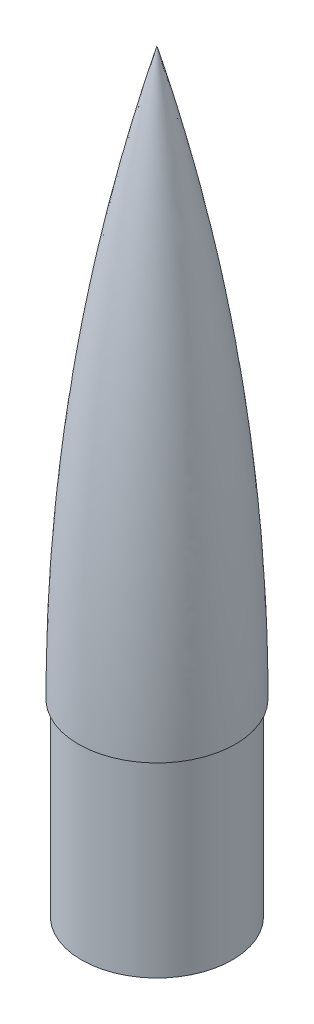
ISO-10303-21;
HEADER;
FILE_DESCRIPTION(('STEP AP214'),'2;1');
FILE_NAME('part.step','',(''),(''),'','','');
FILE_SCHEMA(('AUTOMOTIVE_DESIGN { 1 0 10303 214 1 1 1 1 }'));
ENDSEC;
DATA;
#1=APPLICATION_CONTEXT('core data for automotive mechanical design processes');
#2=APPLICATION_PROTOCOL_DEFINITION('international standard','automotive_design',2000,#1);
#3=PRODUCT_CONTEXT('',#1,'mechanical');
#4=PRODUCT('Part','Part','',(#3));
#5=PRODUCT_RELATED_PRODUCT_CATEGORY('part','',(#4));
#6=PRODUCT_DEFINITION_FORMATION('','',#4);
#7=PRODUCT_DEFINITION_CONTEXT('part definition',#1,'design');
#8=PRODUCT_DEFINITION('design','',#6,#7);
#9=PRODUCT_DEFINITION_SHAPE('','',#8);
#10=(LENGTH_UNIT() NAMED_UNIT(*) SI_UNIT(.MILLI.,.METRE.));
#11=(NAMED_UNIT(*) PLANE_ANGLE_UNIT() SI_UNIT($,.RADIAN.));
#12=(NAMED_UNIT(*) SI_UNIT($,.STERADIAN.) SOLID_ANGLE_UNIT());
#13=UNCERTAINTY_MEASURE_WITH_UNIT(LENGTH_MEASURE(1.E-05),#10,'distance_accuracy_value','');
#14=(GEOMETRIC_REPRESENTATION_CONTEXT(3) GLOBAL_UNCERTAINTY_ASSIGNED_CONTEXT((#13)) GLOBAL_UNIT_ASSIGNED_CONTEXT((#10,
#11,#12)) REPRESENTATION_CONTEXT('',''));
#15=CARTESIAN_POINT('',(0.,0.,0.));
#16=DIRECTION('',(0.,0.,1.));
#17=DIRECTION('',(1.,0.,0.));
#18=AXIS2_PLACEMENT_3D('',#15,#16,#17);
#19=CARTESIAN_POINT('',(0.,95.2500000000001,-1008.85625));
#20=DIRECTION('',(-1.,0.,0.));
#21=DIRECTION('',(0.,0.,1.));
#22=AXIS2_PLACEMENT_3D('',#19,#20,#21);
#23=CIRCLE('',#22,1048.54375);
#24=TRIMMED_CURVE('',#23,(PARAMETER_VALUE(-0.276012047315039)),
(PARAMETER_VALUE(0.276012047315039)),.T.,.PARAMETER.);
#25=CARTESIAN_POINT('',(0.,95.2500000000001,0.));
#26=DIRECTION('',(0.,1.,0.));
#27=AXIS1_PLACEMENT('',#25,#26);
#28=SURFACE_OF_REVOLUTION('',#24,#27);
#29=CARTESIAN_POINT('',(0.,381.,0.));
#30=VERTEX_POINT('',#29);
#31=VERTEX_LOOP('',#30);
#32=FACE_BOUND('',#31,.T.);
#33=CARTESIAN_POINT('',(0.,95.25,0.));
#34=DIRECTION('',(0.,1.,0.));
#35=DIRECTION('',(0.,0.,1.));
#36=AXIS2_PLACEMENT_3D('',#33,#34,#35);
#37=CIRCLE('',#36,39.6875);
#38=CARTESIAN_POINT('',(0.,95.25,39.6875));
#39=VERTEX_POINT('',#38);
#40=EDGE_CURVE('E11',#39,#39,#37,.T.);
#41=ORIENTED_EDGE('',*,*,#40,.T.);
#42=EDGE_LOOP('',(#41));
#43=FACE_BOUND('',#42,.T.);
#44=ADVANCED_FACE('F31',(#32,#43),#28,.T.);
#45=CARTESIAN_POINT('',(-19.8437499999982,95.25,0.));
#46=DIRECTION('',(0.,1.,0.));
#47=DIRECTION('',(0.,0.,1.));
#48=AXIS2_PLACEMENT_3D('',#45,#46,#47);
#49=PLANE('',#48);
#50=ORIENTED_EDGE('',*,*,#40,.F.);
#51=EDGE_LOOP('',(#50));
#52=FACE_BOUND('',#51,.T.);
#53=CARTESIAN_POINT('',(0.,95.25,0.));
#54=DIRECTION('',(0.,1.,0.));
#55=DIRECTION('',(0.,0.,1.));
#56=AXIS2_PLACEMENT_3D('',#53,#54,#55);
#57=CIRCLE('',#56,38.1);
#58=CARTESIAN_POINT('',(0.,95.25,38.1));
#59=VERTEX_POINT('',#58);
#60=EDGE_CURVE('E38',#59,#59,#57,.T.);
#61=ORIENTED_EDGE('',*,*,#60,.T.);
#62=EDGE_LOOP('',(#61));
#63=FACE_BOUND('',#62,.T.);
#64=ADVANCED_FACE('F67',(#52,#63),#49,.F.);
#65=CARTESIAN_POINT('',(0.,381.,0.));
#66=DIRECTION('',(0.,1.,0.));
#67=DIRECTION('',(0.,0.,1.));
#68=AXIS2_PLACEMENT_3D('',#65,#66,#67);
#69=CYLINDRICAL_SURFACE('',#68,38.1);
#70=CARTESIAN_POINT('',(0.,0.,0.));
#71=DIRECTION('',(0.,1.,0.));
#72=DIRECTION('',(0.,0.,1.));
#73=AXIS2_PLACEMENT_3D('',#70,#71,#72);
#74=CIRCLE('',#73,38.1);
#75=CARTESIAN_POINT('',(0.,0.,38.1));
#76=VERTEX_POINT('',#75);
#77=EDGE_CURVE('E54',#76,#76,#74,.T.);
#78=ORIENTED_EDGE('',*,*,#77,.T.);
#79=EDGE_LOOP('',(#78));
#80=FACE_BOUND('',#79,.T.);
#81=ORIENTED_EDGE('',*,*,#60,.F.);
#82=EDGE_LOOP('',(#81));
#83=FACE_BOUND('',#82,.T.);
#84=ADVANCED_FACE('F69',(#80,#83),#69,.T.);
#85=CARTESIAN_POINT('',(-19.84375,0.,0.));
#86=DIRECTION('',(0.,1.,0.));
#87=DIRECTION('',(0.,0.,1.));
#88=AXIS2_PLACEMENT_3D('',#85,#86,#87);
#89=PLANE('',#88);
#90=CARTESIAN_POINT('',(0.,0.,0.));
#91=DIRECTION('',(0.,1.,0.));
#92=DIRECTION('',(0.,0.,1.));
#93=AXIS2_PLACEMENT_3D('',#90,#91,#92);
#94=CIRCLE('',#93,36.5125);
#95=CARTESIAN_POINT('',(0.,0.,36.5125));
#96=VERTEX_POINT('',#95);
#97=EDGE_CURVE('E60',#96,#96,#94,.T.);
#98=ORIENTED_EDGE('',*,*,#97,.T.);
#99=EDGE_LOOP('',(#98));
#100=FACE_BOUND('',#99,.T.);
#101=ORIENTED_EDGE('',*,*,#77,.F.);
#102=EDGE_LOOP('',(#101));
#103=FACE_BOUND('',#102,.T.);
#104=ADVANCED_FACE('F48',(#100,#103),#89,.F.);
#105=CARTESIAN_POINT('',(0.,95.2500000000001,-1008.85625));
#106=DIRECTION('',(-1.,0.,0.));
#107=DIRECTION('',(0.,0.,1.));
#108=AXIS2_PLACEMENT_3D('',#105,#106,#107);
#109=CIRCLE('',#108,1046.95625);
#110=TRIMMED_CURVE('',#109,(PARAMETER_VALUE(-0.270607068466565)),
(PARAMETER_VALUE(0.270607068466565)),.T.,.PARAMETER.);
#111=CARTESIAN_POINT('',(0.,95.2500000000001,0.));
#112=DIRECTION('',(0.,1.,0.));
#113=AXIS1_PLACEMENT('',#111,#112);
#114=SURFACE_OF_REVOLUTION('',#110,#113);
#115=CARTESIAN_POINT('',(0.,375.118641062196,0.));
#116=VERTEX_POINT('',#115);
#117=VERTEX_LOOP('',#116);
#118=FACE_BOUND('',#117,.T.);
#119=CARTESIAN_POINT('',(0.,96.8375,0.));
#120=DIRECTION('',(0.,1.,0.));
#121=DIRECTION('',(0.,0.,1.));
#122=AXIS2_PLACEMENT_3D('',#119,#120,#121);
#123=CIRCLE('',#122,38.0987964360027);
#124=CARTESIAN_POINT('',(0.,96.8375,38.0987964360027));
#125=VERTEX_POINT('',#124);
#126=EDGE_CURVE('E52',#125,#125,#123,.T.);
#127=ORIENTED_EDGE('',*,*,#126,.F.);
#128=EDGE_LOOP('',(#127));
#129=FACE_BOUND('',#128,.T.);
#130=ADVANCED_FACE('F44',(#118,#129),#114,.F.);
#131=CARTESIAN_POINT('',(-19.8437499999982,96.8375,0.));
#132=DIRECTION('',(0.,1.,0.));
#133=DIRECTION('',(0.,0.,1.));
#134=AXIS2_PLACEMENT_3D('',#131,#132,#133);
#135=PLANE('',#134);
#136=ORIENTED_EDGE('',*,*,#126,.T.);
#137=EDGE_LOOP('',(#136));
#138=FACE_BOUND('',#137,.T.);
#139=CARTESIAN_POINT('',(0.,96.8375,0.));
#140=DIRECTION('',(0.,1.,0.));
#141=DIRECTION('',(0.,0.,1.));
#142=AXIS2_PLACEMENT_3D('',#139,#140,#141);
#143=CIRCLE('',#142,36.5125);
#144=CARTESIAN_POINT('',(0.,96.8375,36.5125));
#145=VERTEX_POINT('',#144);
#146=EDGE_CURVE('E55',#145,#145,#143,.T.);
#147=ORIENTED_EDGE('',*,*,#146,.F.);
#148=EDGE_LOOP('',(#147));
#149=FACE_BOUND('',#148,.T.);
#150=ADVANCED_FACE('F47',(#138,#149),#135,.T.);
#151=CARTESIAN_POINT('',(0.,381.,0.));
#152=DIRECTION('',(0.,1.,0.));
#153=DIRECTION('',(0.,0.,1.));
#154=AXIS2_PLACEMENT_3D('',#151,#152,#153);
#155=CYLINDRICAL_SURFACE('',#154,36.5125);
#156=ORIENTED_EDGE('',*,*,#97,.F.);
#157=EDGE_LOOP('',(#156));
#158=FACE_BOUND('',#157,.T.);
#159=ORIENTED_EDGE('',*,*,#146,.T.);
#160=EDGE_LOOP('',(#159));
#161=FACE_BOUND('',#160,.T.);
#162=ADVANCED_FACE('F115',(#158,#161),#155,.F.);
#163=CLOSED_SHELL('',(#44,#64,#84,#104,#130,#150,#162));
#164=MANIFOLD_SOLID_BREP('B2',#163);
#165=ADVANCED_BREP_SHAPE_REPRESENTATION('',(#18,#164),#14);
#166=SHAPE_DEFINITION_REPRESENTATION(#9,#165);
ENDSEC;
END-ISO-10303-21;
